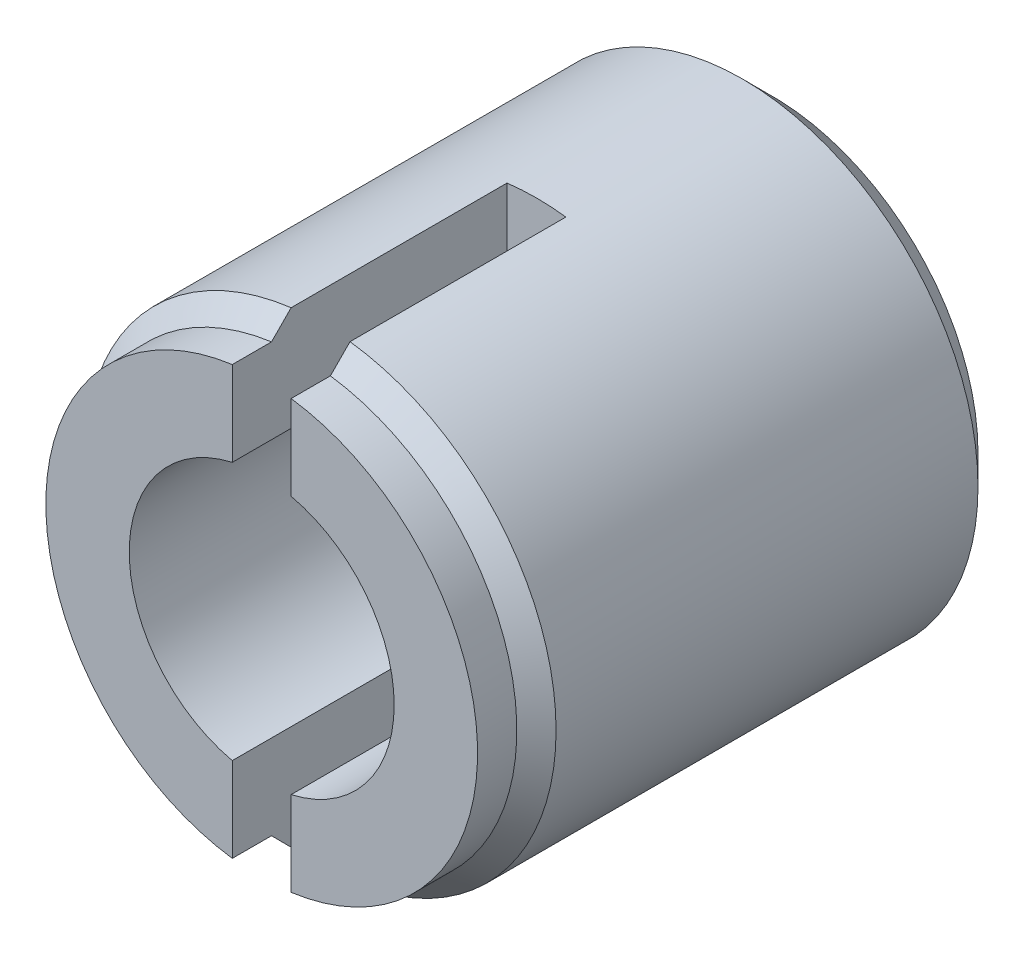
ISO-10303-21;
HEADER;
FILE_DESCRIPTION(('STEP AP214'),'2;1');
FILE_NAME('part.step','',(''),(''),'','','');
FILE_SCHEMA(('AUTOMOTIVE_DESIGN { 1 0 10303 214 1 1 1 1 }'));
ENDSEC;
DATA;
#1=APPLICATION_CONTEXT('core data for automotive mechanical design processes');
#2=APPLICATION_PROTOCOL_DEFINITION('international standard','automotive_design',2000,#1);
#3=PRODUCT_CONTEXT('',#1,'mechanical');
#4=PRODUCT('Part','Part','',(#3));
#5=PRODUCT_RELATED_PRODUCT_CATEGORY('part','',(#4));
#6=PRODUCT_DEFINITION_FORMATION('','',#4);
#7=PRODUCT_DEFINITION_CONTEXT('part definition',#1,'design');
#8=PRODUCT_DEFINITION('design','',#6,#7);
#9=PRODUCT_DEFINITION_SHAPE('','',#8);
#10=(LENGTH_UNIT() NAMED_UNIT(*) SI_UNIT(.MILLI.,.METRE.));
#11=(NAMED_UNIT(*) PLANE_ANGLE_UNIT() SI_UNIT($,.RADIAN.));
#12=(NAMED_UNIT(*) SI_UNIT($,.STERADIAN.) SOLID_ANGLE_UNIT());
#13=UNCERTAINTY_MEASURE_WITH_UNIT(LENGTH_MEASURE(1.E-05),#10,'distance_accuracy_value','');
#14=(GEOMETRIC_REPRESENTATION_CONTEXT(3) GLOBAL_UNCERTAINTY_ASSIGNED_CONTEXT((#13)) GLOBAL_UNIT_ASSIGNED_CONTEXT((#10,
#11,#12)) REPRESENTATION_CONTEXT('',''));
#15=CARTESIAN_POINT('',(0.,0.,0.));
#16=DIRECTION('',(0.,0.,1.));
#17=DIRECTION('',(1.,0.,0.));
#18=AXIS2_PLACEMENT_3D('',#15,#16,#17);
#19=CARTESIAN_POINT('',(0.,0.,0.));
#20=DIRECTION('',(0.,0.,1.));
#21=DIRECTION('',(1.,0.,0.));
#22=AXIS2_PLACEMENT_3D('',#19,#20,#21);
#23=PLANE('',#22);
#24=DIRECTION('',(0.,-1.,0.));
#25=VECTOR('',#24,1.);
#26=CARTESIAN_POINT('',(-0.749999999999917,6.5,0.));
#27=LINE('',#26,#25);
#28=CARTESIAN_POINT('',(-0.749999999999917,5.44862367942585,0.));
#29=VERTEX_POINT('',#28);
#30=CARTESIAN_POINT('',(-0.749999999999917,3.29061164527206,0.));
#31=VERTEX_POINT('',#30);
#32=EDGE_CURVE('E250',#29,#31,#27,.T.);
#33=ORIENTED_EDGE('',*,*,#32,.F.);
#34=CARTESIAN_POINT('',(0.,0.,0.));
#35=DIRECTION('',(0.,0.,1.));
#36=DIRECTION('',(1.,0.,0.));
#37=AXIS2_PLACEMENT_3D('',#34,#35,#36);
#38=CIRCLE('',#37,5.5);
#39=CARTESIAN_POINT('',(-0.749999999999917,-5.44862367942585,0.));
#40=VERTEX_POINT('',#39);
#41=EDGE_CURVE('E161',#29,#40,#38,.T.);
#42=ORIENTED_EDGE('',*,*,#41,.T.);
#43=CARTESIAN_POINT('',(-0.749999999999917,-3.29061164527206,0.));
#44=VERTEX_POINT('',#43);
#45=EDGE_CURVE('E257',#44,#40,#27,.T.);
#46=ORIENTED_EDGE('',*,*,#45,.F.);
#47=CARTESIAN_POINT('',(0.,0.,0.));
#48=DIRECTION('',(0.,0.,1.));
#49=DIRECTION('',(1.,0.,0.));
#50=AXIS2_PLACEMENT_3D('',#47,#48,#49);
#51=CIRCLE('',#50,3.375);
#52=EDGE_CURVE('E180',#31,#44,#51,.T.);
#53=ORIENTED_EDGE('',*,*,#52,.F.);
#54=EDGE_LOOP('',(#33,#42,#46,#53));
#55=FACE_BOUND('',#54,.T.);
#56=ADVANCED_FACE('F45',(#55),#23,.T.);
#57=CARTESIAN_POINT('',(0.,0.,-1.));
#58=DIRECTION('',(0.,0.,1.));
#59=DIRECTION('',(1.,0.,0.));
#60=AXIS2_PLACEMENT_3D('',#57,#58,#59);
#61=CYLINDRICAL_SURFACE('',#60,5.5);
#62=DIRECTION('',(0.,0.,1.));
#63=VECTOR('',#62,1.);
#64=CARTESIAN_POINT('',(-0.749999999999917,-5.44862367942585,-1.));
#65=LINE('',#64,#63);
#66=CARTESIAN_POINT('',(-0.749999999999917,-5.44862367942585,-1.));
#67=VERTEX_POINT('',#66);
#68=EDGE_CURVE('E264',#40,#67,#65,.F.);
#69=ORIENTED_EDGE('',*,*,#68,.F.);
#70=ORIENTED_EDGE('',*,*,#41,.F.);
#71=DIRECTION('',(0.,0.,1.));
#72=VECTOR('',#71,1.);
#73=CARTESIAN_POINT('',(-0.749999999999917,5.44862367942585,-1.));
#74=LINE('',#73,#72);
#75=CARTESIAN_POINT('',(-0.749999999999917,5.44862367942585,-1.));
#76=VERTEX_POINT('',#75);
#77=EDGE_CURVE('E262',#76,#29,#74,.T.);
#78=ORIENTED_EDGE('',*,*,#77,.F.);
#79=CARTESIAN_POINT('',(0.,0.,-1.));
#80=DIRECTION('',(0.,0.,1.));
#81=DIRECTION('',(1.,0.,0.));
#82=AXIS2_PLACEMENT_3D('',#79,#80,#81);
#83=CIRCLE('',#82,5.5);
#84=EDGE_CURVE('E177',#76,#67,#83,.T.);
#85=ORIENTED_EDGE('',*,*,#84,.T.);
#86=EDGE_LOOP('',(#69,#70,#78,#85));
#87=FACE_BOUND('',#86,.T.);
#88=ADVANCED_FACE('F221',(#87),#61,.T.);
#89=CARTESIAN_POINT('',(0.,0.,-1.5));
#90=DIRECTION('',(0.,0.,-1.));
#91=DIRECTION('',(-1.,0.,0.));
#92=AXIS2_PLACEMENT_3D('',#89,#90,#91);
#93=CONICAL_SURFACE('',#92,6.,0.785398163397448);
#94=CARTESIAN_POINT('',(-0.749999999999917,13.1851336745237,-8.70644728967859));
#95=CARTESIAN_POINT('',(-0.749999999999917,12.736592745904,-8.25863569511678));
#96=CARTESIAN_POINT('',(-0.749999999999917,12.2880201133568,-7.81085584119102));
#97=CARTESIAN_POINT('',(-0.749999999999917,11.3907667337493,-6.91539431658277));
#98=CARTESIAN_POINT('',(-0.749999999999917,10.9420859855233,-6.46771264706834));
#99=CARTESIAN_POINT('',(-0.749999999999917,10.0444681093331,-5.572378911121));
#100=CARTESIAN_POINT('',(-0.749999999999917,9.59553094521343,-5.12472688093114));
#101=CARTESIAN_POINT('',(-0.749999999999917,8.69744500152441,-4.22964505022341));
#102=CARTESIAN_POINT('',(-0.749999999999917,8.24829622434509,-3.78221524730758));
#103=CARTESIAN_POINT('',(-0.749999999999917,7.33438080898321,-2.87249069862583));
#104=CARTESIAN_POINT('',(-0.749999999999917,6.86960238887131,-2.41020778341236));
#105=CARTESIAN_POINT('',(-0.749999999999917,6.17193034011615,-1.71727512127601));
#106=CARTESIAN_POINT('',(-0.749999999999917,5.93928489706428,-1.48637553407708));
#107=CARTESIAN_POINT('',(-0.749999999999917,5.47375760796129,-1.02481637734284));
#108=CARTESIAN_POINT('',(-0.749999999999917,5.24087576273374,-0.794156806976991));
#109=CARTESIAN_POINT('',(-0.749999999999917,4.77480411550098,-0.333224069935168));
#110=CARTESIAN_POINT('',(-0.749999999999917,4.54161436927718,-0.102950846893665));
#111=CARTESIAN_POINT('',(-0.749999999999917,4.07469291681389,0.357051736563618));
#112=CARTESIAN_POINT('',(-0.749999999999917,3.84096120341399,0.586781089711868));
#113=CARTESIAN_POINT('',(-0.749999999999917,3.37262751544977,1.04532489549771));
#114=CARTESIAN_POINT('',(-0.749999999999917,3.13802559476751,1.27413940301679));
#115=CARTESIAN_POINT('',(-0.749999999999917,2.78486416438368,1.61605698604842));
#116=CARTESIAN_POINT('',(-0.749999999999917,2.66693520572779,1.72981093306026));
#117=CARTESIAN_POINT('',(-0.749999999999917,2.4304597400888,1.95667467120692));
#118=CARTESIAN_POINT('',(-0.749999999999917,2.31191323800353,2.06978446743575));
#119=CARTESIAN_POINT('',(-0.749999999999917,2.12885004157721,2.24299338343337));
#120=CARTESIAN_POINT('',(-0.749999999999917,2.06466849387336,2.3034465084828));
#121=CARTESIAN_POINT('',(-0.749999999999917,1.93594853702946,2.42397386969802));
#122=CARTESIAN_POINT('',(-0.749999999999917,1.87141012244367,2.48404810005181));
#123=CARTESIAN_POINT('',(-0.749999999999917,1.74208397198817,2.6034923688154));
#124=CARTESIAN_POINT('',(-0.749999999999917,1.67729779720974,2.66286409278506));
#125=CARTESIAN_POINT('',(-0.749999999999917,1.54709893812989,2.78091118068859));
#126=CARTESIAN_POINT('',(-0.749999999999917,1.48168627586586,2.83958656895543));
#127=CARTESIAN_POINT('',(-0.749999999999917,1.32766860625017,2.97570825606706));
#128=CARTESIAN_POINT('',(-0.749999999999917,1.2387214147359,3.05277214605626));
#129=CARTESIAN_POINT('',(-0.749999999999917,1.1030978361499,3.16631265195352));
#130=CARTESIAN_POINT('',(-0.749999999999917,1.05737851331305,3.20392965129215));
#131=CARTESIAN_POINT('',(-0.749999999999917,0.96506903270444,3.27807629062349));
#132=CARTESIAN_POINT('',(-0.749999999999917,0.918478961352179,3.31460603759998));
#133=CARTESIAN_POINT('',(-0.749999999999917,0.823540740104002,3.38656112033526));
#134=CARTESIAN_POINT('',(-0.749999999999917,0.775178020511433,3.42196736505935));
#135=CARTESIAN_POINT('',(-0.749999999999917,0.676711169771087,3.4904545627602));
#136=CARTESIAN_POINT('',(-0.749999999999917,0.626604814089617,3.52353236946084));
#137=CARTESIAN_POINT('',(-0.749999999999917,0.524525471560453,3.58567388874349));
#138=CARTESIAN_POINT('',(-0.749999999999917,0.47257253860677,3.61477004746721));
#139=CARTESIAN_POINT('',(-0.749999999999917,0.365715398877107,3.66687999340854));
#140=CARTESIAN_POINT('',(-0.749999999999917,0.310820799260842,3.6899122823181));
#141=CARTESIAN_POINT('',(-0.749999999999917,0.228557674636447,3.71632578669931));
#142=CARTESIAN_POINT('',(-0.749999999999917,0.202441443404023,3.72358425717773));
#143=CARTESIAN_POINT('',(-0.749999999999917,0.14964038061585,3.73564917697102));
#144=CARTESIAN_POINT('',(-0.749999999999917,0.122955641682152,3.74045602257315));
#145=CARTESIAN_POINT('',(-0.749999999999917,0.0693796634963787,3.74726330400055));
#146=CARTESIAN_POINT('',(-0.749999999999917,0.0424905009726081,3.74927975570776));
#147=CARTESIAN_POINT('',(-0.749999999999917,-0.0113498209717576,3.75039703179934));
#148=CARTESIAN_POINT('',(-0.749999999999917,-0.0383009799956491,3.74949787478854));
#149=CARTESIAN_POINT('',(-0.749999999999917,-0.0918466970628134,3.74486657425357));
#150=CARTESIAN_POINT('',(-0.749999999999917,-0.118442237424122,3.74114552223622));
#151=CARTESIAN_POINT('',(-0.749999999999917,-0.171152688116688,3.73115515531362));
#152=CARTESIAN_POINT('',(-0.749999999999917,-0.197267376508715,3.7248846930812));
#153=CARTESIAN_POINT('',(-0.749999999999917,-0.249055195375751,3.71012208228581));
#154=CARTESIAN_POINT('',(-0.749999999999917,-0.274723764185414,3.70161418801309));
#155=CARTESIAN_POINT('',(-0.749999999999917,-0.325378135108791,3.68279852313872));
#156=CARTESIAN_POINT('',(-0.749999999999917,-0.350364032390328,3.67249100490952));
#157=CARTESIAN_POINT('',(-0.749999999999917,-0.417367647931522,3.64252891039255));
#158=CARTESIAN_POINT('',(-0.749999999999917,-0.458754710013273,3.62147075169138));
#159=CARTESIAN_POINT('',(-0.749999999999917,-0.539945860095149,3.57647408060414));
#160=CARTESIAN_POINT('',(-0.749999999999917,-0.57974818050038,3.55253246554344));
#161=CARTESIAN_POINT('',(-0.749999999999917,-0.658212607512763,3.5025904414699));
#162=CARTESIAN_POINT('',(-0.749999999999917,-0.696870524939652,3.47658350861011));
#163=CARTESIAN_POINT('',(-0.749999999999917,-0.773199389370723,3.42315328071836));
#164=CARTESIAN_POINT('',(-0.749999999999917,-0.810870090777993,3.39572963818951));
#165=CARTESIAN_POINT('',(-0.749999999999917,-0.923414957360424,3.31143699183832));
#166=CARTESIAN_POINT('',(-0.749999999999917,-0.997121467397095,3.25301354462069));
#167=CARTESIAN_POINT('',(-0.749999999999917,-1.10615040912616,3.16371701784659));
#168=CARTESIAN_POINT('',(-0.749999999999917,-1.1421987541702,3.13370913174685));
#169=CARTESIAN_POINT('',(-0.749999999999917,-1.21390128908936,3.07322670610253));
#170=CARTESIAN_POINT('',(-0.749999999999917,-1.2495554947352,3.04275218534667));
#171=CARTESIAN_POINT('',(-0.749999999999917,-1.3545517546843,2.95207293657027));
#172=CARTESIAN_POINT('',(-0.749999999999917,-1.42344753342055,2.89135267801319));
#173=CARTESIAN_POINT('',(-0.749999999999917,-1.56040683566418,2.76897864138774));
#174=CARTESIAN_POINT('',(-0.749999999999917,-1.62847032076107,2.707324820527));
#175=CARTESIAN_POINT('',(-0.749999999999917,-1.83179592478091,2.52138236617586));
#176=CARTESIAN_POINT('',(-0.749999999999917,-1.96617451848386,2.39612917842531));
#177=CARTESIAN_POINT('',(-0.749999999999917,-2.23378193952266,2.14409118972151));
#178=CARTESIAN_POINT('',(-0.749999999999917,-2.3670092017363,2.017304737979));
#179=CARTESIAN_POINT('',(-0.749999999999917,-2.63263206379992,1.76288561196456));
#180=CARTESIAN_POINT('',(-0.749999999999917,-2.76502773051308,1.63525300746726));
#181=CARTESIAN_POINT('',(-0.749999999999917,-3.02794766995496,1.38072127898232));
#182=CARTESIAN_POINT('',(-0.749999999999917,-3.15847735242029,1.25382773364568));
#183=CARTESIAN_POINT('',(-0.749999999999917,-3.41916978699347,0.999658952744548));
#184=CARTESIAN_POINT('',(-0.749999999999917,-3.54933253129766,0.872383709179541));
#185=CARTESIAN_POINT('',(-0.749999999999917,-3.93929772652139,0.490281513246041));
#186=CARTESIAN_POINT('',(-0.749999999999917,-4.1987062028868,0.235052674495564));
#187=CARTESIAN_POINT('',(-0.749999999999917,-4.81964098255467,-0.377279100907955));
#188=CARTESIAN_POINT('',(-0.749999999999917,-5.18088905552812,-0.734663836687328));
#189=CARTESIAN_POINT('',(-0.749999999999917,-5.90278036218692,-1.45004571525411));
#190=CARTESIAN_POINT('',(-0.749999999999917,-6.26342359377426,-1.80804286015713));
#191=CARTESIAN_POINT('',(-0.749999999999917,-7.34498080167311,-2.88271543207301));
#192=CARTESIAN_POINT('',(-0.749999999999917,-8.06536878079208,-3.59992005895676));
#193=CARTESIAN_POINT('',(-0.749999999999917,-9.51925927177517,-5.04856858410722));
#194=CARTESIAN_POINT('',(-0.749999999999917,-10.2527505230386,-5.78002377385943));
#195=CARTESIAN_POINT('',(-0.749999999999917,-11.3526556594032,-6.87737546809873));
#196=CARTESIAN_POINT('',(-0.749999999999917,-11.7191945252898,-7.24314668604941));
#197=CARTESIAN_POINT('',(-0.749999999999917,-12.4522077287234,-7.97475344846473));
#198=CARTESIAN_POINT('',(-0.749999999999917,-12.8186820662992,-8.3405889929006));
#199=CARTESIAN_POINT('',(-0.749999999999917,-13.1851336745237,-8.70644728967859));
#200=B_SPLINE_CURVE_WITH_KNOTS('',3,(#94,#95,#96,#97,#98,#99,#100,#101,#102,#103,#104,#105,#106,
#107,#108,#109,#110,#111,#112,#113,#114,#115,#116,#117,#118,#119,#120,#121,#122,#123,#124,#125,
#126,#127,#128,#129,#130,#131,#132,#133,#134,#135,#136,#137,#138,#139,#140,#141,#142,#143,#144,
#145,#146,#147,#148,#149,#150,#151,#152,#153,#154,#155,#156,#157,#158,#159,#160,#161,#162,#163,
#164,#165,#166,#167,#168,#169,#170,#171,#172,#173,#174,#175,#176,#177,#178,#179,#180,#181,#182,
#183,#184,#185,#186,#187,#188,#189,#190,#191,#192,#193,#194,#195,#196,#197,#198,#199),
.UNSPECIFIED.,.F.,.F.,(4,2,2,2,2,2,2,2,2,2,2,2,2,2,2,2,2,2,2,2,2,2,2,2,2,2,2,2,2,2,2,2,2,2,2,2,
2,2,2,2,2,2,2,2,2,2,2,2,2,2,2,2,4),(0.,1.90145148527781,3.80292448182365,5.70487927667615,
7.60681308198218,9.57341382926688,10.5567481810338,11.5400791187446,12.5232513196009,
13.5064365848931,14.4895619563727,14.9811140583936,15.4726622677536,15.7371694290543,
16.0016806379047,16.2653051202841,16.5289203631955,16.8819352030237,17.0595407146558,
17.2371286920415,17.41689924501,17.5969082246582,17.7753497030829,17.9532402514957,
18.0344623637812,18.1156713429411,18.1964122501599,18.2771526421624,18.3575773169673,
18.43803822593,18.5190812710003,18.6001129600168,18.7392335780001,18.8785052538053,
19.0182358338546,19.1580008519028,19.4400527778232,19.5807640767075,19.7214697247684,
19.9969595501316,20.2724620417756,20.8235416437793,21.3752795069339,21.9269724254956,
22.4731031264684,23.0192453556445,24.1109899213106,25.6354610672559,27.1599374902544,
30.209538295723,33.3171619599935,34.8706270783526,36.4240915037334),.UNSPECIFIED.);
#201=CARTESIAN_POINT('',(-0.749999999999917,5.95294044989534,-1.5));
#202=VERTEX_POINT('',#201);
#203=EDGE_CURVE('E333',#202,#76,#200,.T.);
#204=ORIENTED_EDGE('',*,*,#203,.F.);
#205=CARTESIAN_POINT('',(0.,0.,-1.5));
#206=DIRECTION('',(0.,0.,1.));
#207=DIRECTION('',(1.,0.,0.));
#208=AXIS2_PLACEMENT_3D('',#205,#206,#207);
#209=CIRCLE('',#208,6.);
#210=CARTESIAN_POINT('',(-0.749999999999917,-5.95294044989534,-1.5));
#211=VERTEX_POINT('',#210);
#212=EDGE_CURVE('E193',#211,#202,#209,.F.);
#213=ORIENTED_EDGE('',*,*,#212,.F.);
#214=EDGE_CURVE('E201',#67,#211,#200,.T.);
#215=ORIENTED_EDGE('',*,*,#214,.F.);
#216=ORIENTED_EDGE('',*,*,#84,.F.);
#217=EDGE_LOOP('',(#204,#213,#215,#216));
#218=FACE_BOUND('',#217,.T.);
#219=ADVANCED_FACE('F234',(#218),#93,.T.);
#220=CARTESIAN_POINT('',(0.,0.,-13.));
#221=DIRECTION('',(0.,0.,1.));
#222=DIRECTION('',(1.,0.,0.));
#223=AXIS2_PLACEMENT_3D('',#220,#221,#222);
#224=CYLINDRICAL_SURFACE('',#223,6.);
#225=DIRECTION('',(0.,0.,1.));
#226=VECTOR('',#225,1.);
#227=CARTESIAN_POINT('',(-0.749999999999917,-5.95294044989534,-13.));
#228=LINE('',#227,#226);
#229=CARTESIAN_POINT('',(-0.749999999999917,-5.95294044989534,-7.));
#230=VERTEX_POINT('',#229);
#231=EDGE_CURVE('E267',#211,#230,#228,.F.);
#232=ORIENTED_EDGE('',*,*,#231,.F.);
#233=ORIENTED_EDGE('',*,*,#212,.T.);
#234=DIRECTION('',(0.,0.,1.));
#235=VECTOR('',#234,1.);
#236=CARTESIAN_POINT('',(-0.749999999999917,5.95294044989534,-13.));
#237=LINE('',#236,#235);
#238=CARTESIAN_POINT('',(-0.749999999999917,5.95294044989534,-7.));
#239=VERTEX_POINT('',#238);
#240=EDGE_CURVE('E280',#239,#202,#237,.T.);
#241=ORIENTED_EDGE('',*,*,#240,.F.);
#242=CARTESIAN_POINT('',(0.,0.,-7.));
#243=DIRECTION('',(0.,0.,1.));
#244=DIRECTION('',(1.,0.,0.));
#245=AXIS2_PLACEMENT_3D('',#242,#243,#244);
#246=CIRCLE('',#245,6.);
#247=CARTESIAN_POINT('',(0.749999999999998,5.95294044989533,-7.));
#248=VERTEX_POINT('',#247);
#249=EDGE_CURVE('E169',#239,#248,#246,.F.);
#250=ORIENTED_EDGE('',*,*,#249,.T.);
#251=DIRECTION('',(0.,0.,1.));
#252=VECTOR('',#251,1.);
#253=CARTESIAN_POINT('',(0.749999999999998,5.95294044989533,-13.));
#254=LINE('',#253,#252);
#255=CARTESIAN_POINT('',(0.749999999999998,5.95294044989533,-1.5));
#256=VERTEX_POINT('',#255);
#257=EDGE_CURVE('E145',#256,#248,#254,.F.);
#258=ORIENTED_EDGE('',*,*,#257,.F.);
#259=CARTESIAN_POINT('',(0.749999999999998,-5.95294044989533,-1.5));
#260=VERTEX_POINT('',#259);
#261=EDGE_CURVE('E189',#256,#260,#209,.F.);
#262=ORIENTED_EDGE('',*,*,#261,.T.);
#263=DIRECTION('',(0.,0.,1.));
#264=VECTOR('',#263,1.);
#265=CARTESIAN_POINT('',(0.749999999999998,-5.95294044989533,-13.));
#266=LINE('',#265,#264);
#267=CARTESIAN_POINT('',(0.749999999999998,-5.95294044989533,-7.));
#268=VERTEX_POINT('',#267);
#269=EDGE_CURVE('E62',#268,#260,#266,.T.);
#270=ORIENTED_EDGE('',*,*,#269,.F.);
#271=EDGE_CURVE('E162',#268,#230,#246,.F.);
#272=ORIENTED_EDGE('',*,*,#271,.T.);
#273=EDGE_LOOP('',(#232,#233,#241,#250,#258,#262,#270,#272));
#274=FACE_BOUND('',#273,.T.);
#275=CARTESIAN_POINT('',(0.,0.,-12.25));
#276=DIRECTION('',(0.,0.,1.));
#277=DIRECTION('',(1.,0.,0.));
#278=AXIS2_PLACEMENT_3D('',#275,#276,#277);
#279=CIRCLE('',#278,6.);
#280=CARTESIAN_POINT('',(6.,0.,-12.25));
#281=VERTEX_POINT('',#280);
#282=EDGE_CURVE('E181',#281,#281,#279,.T.);
#283=ORIENTED_EDGE('',*,*,#282,.T.);
#284=EDGE_LOOP('',(#283));
#285=FACE_BOUND('',#284,.T.);
#286=ADVANCED_FACE('F232',(#274,#285),#224,.T.);
#287=DIRECTION('',(0.,1.,0.));
#288=VECTOR('',#287,1.);
#289=CARTESIAN_POINT('',(0.749999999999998,6.5,0.));
#290=LINE('',#289,#288);
#291=CARTESIAN_POINT('',(0.749999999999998,-5.44862367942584,0.));
#292=VERTEX_POINT('',#291);
#293=CARTESIAN_POINT('',(0.749999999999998,-3.29061164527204,0.));
#294=VERTEX_POINT('',#293);
#295=EDGE_CURVE('E137',#292,#294,#290,.T.);
#296=ORIENTED_EDGE('',*,*,#295,.F.);
#297=CARTESIAN_POINT('',(0.749999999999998,5.44862367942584,0.));
#298=VERTEX_POINT('',#297);
#299=EDGE_CURVE('E152',#292,#298,#38,.T.);
#300=ORIENTED_EDGE('',*,*,#299,.T.);
#301=CARTESIAN_POINT('',(0.749999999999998,3.29061164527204,0.));
#302=VERTEX_POINT('',#301);
#303=EDGE_CURVE('E157',#302,#298,#290,.T.);
#304=ORIENTED_EDGE('',*,*,#303,.F.);
#305=EDGE_CURVE('E154',#294,#302,#51,.T.);
#306=ORIENTED_EDGE('',*,*,#305,.F.);
#307=EDGE_LOOP('',(#296,#300,#304,#306));
#308=FACE_BOUND('',#307,.T.);
#309=ADVANCED_FACE('F150',(#308),#23,.T.);
#310=CARTESIAN_POINT('',(0.,0.,-13.));
#311=DIRECTION('',(0.,0.,1.));
#312=DIRECTION('',(1.,0.,0.));
#313=AXIS2_PLACEMENT_3D('',#310,#311,#312);
#314=PLANE('',#313);
#315=CARTESIAN_POINT('',(0.,0.,-13.));
#316=DIRECTION('',(0.,0.,1.));
#317=DIRECTION('',(1.,0.,0.));
#318=AXIS2_PLACEMENT_3D('',#315,#316,#317);
#319=CIRCLE('',#318,5.24999999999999);
#320=CARTESIAN_POINT('',(5.24999999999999,0.,-13.));
#321=VERTEX_POINT('',#320);
#322=EDGE_CURVE('E185',#321,#321,#319,.F.);
#323=ORIENTED_EDGE('',*,*,#322,.T.);
#324=EDGE_LOOP('',(#323));
#325=FACE_BOUND('',#324,.T.);
#326=CARTESIAN_POINT('',(0.,0.,-13.));
#327=DIRECTION('',(0.,0.,1.));
#328=DIRECTION('',(1.,0.,0.));
#329=AXIS2_PLACEMENT_3D('',#326,#327,#328);
#330=CIRCLE('',#329,3.375);
#331=CARTESIAN_POINT('',(3.375,0.,-13.));
#332=VERTEX_POINT('',#331);
#333=EDGE_CURVE('E173',#332,#332,#330,.T.);
#334=ORIENTED_EDGE('',*,*,#333,.T.);
#335=EDGE_LOOP('',(#334));
#336=FACE_BOUND('',#335,.T.);
#337=ADVANCED_FACE('F225',(#325,#336),#314,.F.);
#338=CARTESIAN_POINT('',(0.,0.,0.));
#339=DIRECTION('',(0.,0.,1.));
#340=DIRECTION('',(1.,0.,0.));
#341=AXIS2_PLACEMENT_3D('',#338,#339,#340);
#342=CYLINDRICAL_SURFACE('',#341,3.375);
#343=ORIENTED_EDGE('',*,*,#52,.T.);
#344=DIRECTION('',(0.,0.,1.));
#345=VECTOR('',#344,1.);
#346=CARTESIAN_POINT('',(-0.749999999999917,-3.29061164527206,0.));
#347=LINE('',#346,#345);
#348=CARTESIAN_POINT('',(-0.749999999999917,-3.29061164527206,-7.));
#349=VERTEX_POINT('',#348);
#350=EDGE_CURVE('E286',#44,#349,#347,.F.);
#351=ORIENTED_EDGE('',*,*,#350,.T.);
#352=CARTESIAN_POINT('',(0.,0.,-7.));
#353=DIRECTION('',(0.,0.,1.));
#354=DIRECTION('',(1.,0.,0.));
#355=AXIS2_PLACEMENT_3D('',#352,#353,#354);
#356=CIRCLE('',#355,3.375);
#357=CARTESIAN_POINT('',(0.749999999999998,-3.29061164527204,-7.));
#358=VERTEX_POINT('',#357);
#359=EDGE_CURVE('E11',#358,#349,#356,.F.);
#360=ORIENTED_EDGE('',*,*,#359,.F.);
#361=DIRECTION('',(0.,0.,1.));
#362=VECTOR('',#361,1.);
#363=CARTESIAN_POINT('',(0.749999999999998,-3.29061164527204,0.));
#364=LINE('',#363,#362);
#365=EDGE_CURVE('E274',#358,#294,#364,.T.);
#366=ORIENTED_EDGE('',*,*,#365,.T.);
#367=ORIENTED_EDGE('',*,*,#305,.T.);
#368=DIRECTION('',(0.,0.,1.));
#369=VECTOR('',#368,1.);
#370=CARTESIAN_POINT('',(0.749999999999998,3.29061164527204,0.));
#371=LINE('',#370,#369);
#372=CARTESIAN_POINT('',(0.749999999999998,3.29061164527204,-7.));
#373=VERTEX_POINT('',#372);
#374=EDGE_CURVE('E268',#302,#373,#371,.F.);
#375=ORIENTED_EDGE('',*,*,#374,.T.);
#376=CARTESIAN_POINT('',(-0.749999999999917,3.29061164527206,-7.));
#377=VERTEX_POINT('',#376);
#378=EDGE_CURVE('E50',#377,#373,#356,.F.);
#379=ORIENTED_EDGE('',*,*,#378,.F.);
#380=DIRECTION('',(0.,0.,1.));
#381=VECTOR('',#380,1.);
#382=CARTESIAN_POINT('',(-0.749999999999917,3.29061164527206,0.));
#383=LINE('',#382,#381);
#384=EDGE_CURVE('E283',#377,#31,#383,.T.);
#385=ORIENTED_EDGE('',*,*,#384,.T.);
#386=EDGE_LOOP('',(#343,#351,#360,#366,#367,#375,#379,#385));
#387=FACE_BOUND('',#386,.T.);
#388=ORIENTED_EDGE('',*,*,#333,.F.);
#389=EDGE_LOOP('',(#388));
#390=FACE_BOUND('',#389,.T.);
#391=ADVANCED_FACE('F222',(#387,#390),#342,.F.);
#392=CARTESIAN_POINT('',(0.,0.,-12.25));
#393=DIRECTION('',(0.,0.,1.));
#394=DIRECTION('',(1.,0.,0.));
#395=AXIS2_PLACEMENT_3D('',#392,#393,#394);
#396=CONICAL_SURFACE('',#395,6.,0.785398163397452);
#397=ORIENTED_EDGE('',*,*,#322,.F.);
#398=EDGE_LOOP('',(#397));
#399=FACE_BOUND('',#398,.T.);
#400=ORIENTED_EDGE('',*,*,#282,.F.);
#401=EDGE_LOOP('',(#400));
#402=FACE_BOUND('',#401,.T.);
#403=ADVANCED_FACE('F220',(#399,#402),#396,.T.);
#404=DIRECTION('',(0.,0.,1.));
#405=VECTOR('',#404,1.);
#406=CARTESIAN_POINT('',(0.749999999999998,5.44862367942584,-1.));
#407=LINE('',#406,#405);
#408=CARTESIAN_POINT('',(0.749999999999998,5.44862367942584,-1.));
#409=VERTEX_POINT('',#408);
#410=EDGE_CURVE('E70',#298,#409,#407,.F.);
#411=ORIENTED_EDGE('',*,*,#410,.F.);
#412=ORIENTED_EDGE('',*,*,#299,.F.);
#413=DIRECTION('',(0.,0.,1.));
#414=VECTOR('',#413,1.);
#415=CARTESIAN_POINT('',(0.749999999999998,-5.44862367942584,-1.));
#416=LINE('',#415,#414);
#417=CARTESIAN_POINT('',(0.749999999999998,-5.44862367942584,-1.));
#418=VERTEX_POINT('',#417);
#419=EDGE_CURVE('E134',#418,#292,#416,.T.);
#420=ORIENTED_EDGE('',*,*,#419,.F.);
#421=EDGE_CURVE('E167',#418,#409,#83,.T.);
#422=ORIENTED_EDGE('',*,*,#421,.T.);
#423=EDGE_LOOP('',(#411,#412,#420,#422));
#424=FACE_BOUND('',#423,.T.);
#425=ADVANCED_FACE('F159',(#424),#61,.T.);
#426=CARTESIAN_POINT('',(0.749999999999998,-13.1851336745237,-8.70644728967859));
#427=CARTESIAN_POINT('',(0.749999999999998,-12.736592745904,-8.25863569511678));
#428=CARTESIAN_POINT('',(0.749999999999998,-12.2880201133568,-7.81085584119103));
#429=CARTESIAN_POINT('',(0.749999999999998,-11.3907667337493,-6.91539431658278));
#430=CARTESIAN_POINT('',(0.749999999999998,-10.9420859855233,-6.46771264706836));
#431=CARTESIAN_POINT('',(0.749999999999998,-10.0444681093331,-5.57237891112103));
#432=CARTESIAN_POINT('',(0.749999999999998,-9.59553094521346,-5.12472688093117));
#433=CARTESIAN_POINT('',(0.749999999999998,-8.69744500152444,-4.22964505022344));
#434=CARTESIAN_POINT('',(0.749999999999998,-8.24829622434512,-3.78221524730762));
#435=CARTESIAN_POINT('',(0.749999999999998,-7.33438080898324,-2.87249069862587));
#436=CARTESIAN_POINT('',(0.749999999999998,-6.86960238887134,-2.4102077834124));
#437=CARTESIAN_POINT('',(0.749999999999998,-6.17193034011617,-1.71727512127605));
#438=CARTESIAN_POINT('',(0.749999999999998,-5.9392848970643,-1.48637553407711));
#439=CARTESIAN_POINT('',(0.749999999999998,-5.47375760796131,-1.02481637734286));
#440=CARTESIAN_POINT('',(0.749999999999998,-5.24087576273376,-0.794156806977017));
#441=CARTESIAN_POINT('',(0.749999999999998,-4.774804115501,-0.33322406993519));
#442=CARTESIAN_POINT('',(0.749999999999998,-4.54161436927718,-0.102950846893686));
#443=CARTESIAN_POINT('',(0.749999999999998,-4.07469291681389,0.3570517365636));
#444=CARTESIAN_POINT('',(0.749999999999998,-3.840961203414,0.586781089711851));
#445=CARTESIAN_POINT('',(0.749999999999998,-3.37262751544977,1.04532489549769));
#446=CARTESIAN_POINT('',(0.749999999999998,-3.13802559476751,1.27413940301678));
#447=CARTESIAN_POINT('',(0.749999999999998,-2.78486416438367,1.61605698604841));
#448=CARTESIAN_POINT('',(0.749999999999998,-2.66693520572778,1.72981093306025));
#449=CARTESIAN_POINT('',(0.749999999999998,-2.43045974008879,1.9566746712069));
#450=CARTESIAN_POINT('',(0.749999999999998,-2.31191323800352,2.06978446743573));
#451=CARTESIAN_POINT('',(0.749999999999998,-2.12885004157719,2.24299338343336));
#452=CARTESIAN_POINT('',(0.749999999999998,-2.06466849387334,2.30344650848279));
#453=CARTESIAN_POINT('',(0.749999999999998,-1.93594853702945,2.42397386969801));
#454=CARTESIAN_POINT('',(0.749999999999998,-1.87141012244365,2.4840481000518));
#455=CARTESIAN_POINT('',(0.749999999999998,-1.74208397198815,2.60349236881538));
#456=CARTESIAN_POINT('',(0.749999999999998,-1.67729779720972,2.66286409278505));
#457=CARTESIAN_POINT('',(0.749999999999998,-1.54709893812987,2.78091118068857));
#458=CARTESIAN_POINT('',(0.749999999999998,-1.48168627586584,2.83958656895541));
#459=CARTESIAN_POINT('',(0.749999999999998,-1.32766860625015,2.97570825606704));
#460=CARTESIAN_POINT('',(0.749999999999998,-1.23872141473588,3.05277214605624));
#461=CARTESIAN_POINT('',(0.749999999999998,-1.10309783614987,3.1663126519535));
#462=CARTESIAN_POINT('',(0.749999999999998,-1.05737851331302,3.20392965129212));
#463=CARTESIAN_POINT('',(0.749999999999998,-0.965069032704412,3.27807629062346));
#464=CARTESIAN_POINT('',(0.749999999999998,-0.91847896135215,3.31460603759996));
#465=CARTESIAN_POINT('',(0.749999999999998,-0.823540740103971,3.38656112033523));
#466=CARTESIAN_POINT('',(0.749999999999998,-0.775178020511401,3.42196736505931));
#467=CARTESIAN_POINT('',(0.749999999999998,-0.676711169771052,3.49045456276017));
#468=CARTESIAN_POINT('',(0.749999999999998,-0.62660481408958,3.5235323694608));
#469=CARTESIAN_POINT('',(0.749999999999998,-0.524525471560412,3.58567388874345));
#470=CARTESIAN_POINT('',(0.749999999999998,-0.472572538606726,3.61477004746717));
#471=CARTESIAN_POINT('',(0.749999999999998,-0.36571539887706,3.66687999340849));
#472=CARTESIAN_POINT('',(0.749999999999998,-0.310820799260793,3.68991228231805));
#473=CARTESIAN_POINT('',(0.749999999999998,-0.228557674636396,3.71632578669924));
#474=CARTESIAN_POINT('',(0.749999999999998,-0.202441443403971,3.72358425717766));
#475=CARTESIAN_POINT('',(0.749999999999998,-0.149640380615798,3.73564917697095));
#476=CARTESIAN_POINT('',(0.749999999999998,-0.1229556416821,3.74045602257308));
#477=CARTESIAN_POINT('',(0.749999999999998,-0.0693796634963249,3.74726330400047));
#478=CARTESIAN_POINT('',(0.749999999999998,-0.0424905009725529,3.74927975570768));
#479=CARTESIAN_POINT('',(0.749999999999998,0.0113498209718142,3.75039703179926));
#480=CARTESIAN_POINT('',(0.749999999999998,0.0383009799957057,3.74949787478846));
#481=CARTESIAN_POINT('',(0.749999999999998,0.0918466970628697,3.74486657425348));
#482=CARTESIAN_POINT('',(0.749999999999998,0.118442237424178,3.74114552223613));
#483=CARTESIAN_POINT('',(0.749999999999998,0.171152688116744,3.73115515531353));
#484=CARTESIAN_POINT('',(0.749999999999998,0.197267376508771,3.72488469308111));
#485=CARTESIAN_POINT('',(0.749999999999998,0.249055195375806,3.71012208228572));
#486=CARTESIAN_POINT('',(0.749999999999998,0.274723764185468,3.70161418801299));
#487=CARTESIAN_POINT('',(0.749999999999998,0.325378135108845,3.68279852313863));
#488=CARTESIAN_POINT('',(0.749999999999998,0.350364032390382,3.67249100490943));
#489=CARTESIAN_POINT('',(0.749999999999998,0.417367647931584,3.64252891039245));
#490=CARTESIAN_POINT('',(0.749999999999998,0.458754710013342,3.62147075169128));
#491=CARTESIAN_POINT('',(0.749999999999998,0.539945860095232,3.57647408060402));
#492=CARTESIAN_POINT('',(0.749999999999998,0.579748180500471,3.55253246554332));
#493=CARTESIAN_POINT('',(0.749999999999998,0.658212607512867,3.50259044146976));
#494=CARTESIAN_POINT('',(0.749999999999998,0.696870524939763,3.47658350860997));
#495=CARTESIAN_POINT('',(0.749999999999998,0.773199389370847,3.42315328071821));
#496=CARTESIAN_POINT('',(0.749999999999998,0.810870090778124,3.39572963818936));
#497=CARTESIAN_POINT('',(0.749999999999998,0.923414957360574,3.31143699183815));
#498=CARTESIAN_POINT('',(0.749999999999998,0.997121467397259,3.25301354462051));
#499=CARTESIAN_POINT('',(0.749999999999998,1.10615040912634,3.1637170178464));
#500=CARTESIAN_POINT('',(0.749999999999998,1.14219875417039,3.13370913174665));
#501=CARTESIAN_POINT('',(0.749999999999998,1.21390128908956,3.07322670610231));
#502=CARTESIAN_POINT('',(0.749999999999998,1.24955549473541,3.04275218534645));
#503=CARTESIAN_POINT('',(0.749999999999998,1.35455175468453,2.95207293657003));
#504=CARTESIAN_POINT('',(0.749999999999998,1.42344753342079,2.89135267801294));
#505=CARTESIAN_POINT('',(0.749999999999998,1.56040683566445,2.76897864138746));
#506=CARTESIAN_POINT('',(0.749999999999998,1.62847032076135,2.70732482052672));
#507=CARTESIAN_POINT('',(0.749999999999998,1.83179592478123,2.52138236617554));
#508=CARTESIAN_POINT('',(0.749999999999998,1.9661745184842,2.39612917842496));
#509=CARTESIAN_POINT('',(0.749999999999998,2.23378193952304,2.14409118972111));
#510=CARTESIAN_POINT('',(0.749999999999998,2.36700920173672,2.01730473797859));
#511=CARTESIAN_POINT('',(0.749999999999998,2.63263206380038,1.76288561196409));
#512=CARTESIAN_POINT('',(0.749999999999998,2.76502773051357,1.63525300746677));
#513=CARTESIAN_POINT('',(0.749999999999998,3.02794766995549,1.38072127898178));
#514=CARTESIAN_POINT('',(0.749999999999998,3.15847735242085,1.25382773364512));
#515=CARTESIAN_POINT('',(0.749999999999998,3.41916978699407,0.999658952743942));
#516=CARTESIAN_POINT('',(0.749999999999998,3.54933253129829,0.872383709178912));
#517=CARTESIAN_POINT('',(0.749999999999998,3.93929772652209,0.49028151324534));
#518=CARTESIAN_POINT('',(0.749999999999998,4.19870620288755,0.235052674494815));
#519=CARTESIAN_POINT('',(0.749999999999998,4.81964098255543,-0.37727910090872));
#520=CARTESIAN_POINT('',(0.749999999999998,5.18088905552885,-0.73466383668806));
#521=CARTESIAN_POINT('',(0.749999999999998,5.90278036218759,-1.45004571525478));
#522=CARTESIAN_POINT('',(0.749999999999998,6.26342359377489,-1.80804286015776));
#523=CARTESIAN_POINT('',(0.749999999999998,7.34498080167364,-2.88271543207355));
#524=CARTESIAN_POINT('',(0.749999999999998,8.06536878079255,-3.59992005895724));
#525=CARTESIAN_POINT('',(0.749999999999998,9.51925927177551,-5.04856858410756));
#526=CARTESIAN_POINT('',(0.749999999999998,10.2527505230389,-5.7800237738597));
#527=CARTESIAN_POINT('',(0.749999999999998,11.3526556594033,-6.8773754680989));
#528=CARTESIAN_POINT('',(0.749999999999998,11.7191945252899,-7.24314668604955));
#529=CARTESIAN_POINT('',(0.749999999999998,12.4522077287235,-7.9747534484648));
#530=CARTESIAN_POINT('',(0.749999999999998,12.8186820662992,-8.34058899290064));
#531=CARTESIAN_POINT('',(0.749999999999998,13.1851336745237,-8.70644728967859));
#532=B_SPLINE_CURVE_WITH_KNOTS('',3,(#426,#427,#428,#429,#430,#431,#432,#433,#434,#435,#436,
#437,#438,#439,#440,#441,#442,#443,#444,#445,#446,#447,#448,#449,#450,#451,#452,#453,#454,#455,
#456,#457,#458,#459,#460,#461,#462,#463,#464,#465,#466,#467,#468,#469,#470,#471,#472,#473,#474,
#475,#476,#477,#478,#479,#480,#481,#482,#483,#484,#485,#486,#487,#488,#489,#490,#491,#492,#493,
#494,#495,#496,#497,#498,#499,#500,#501,#502,#503,#504,#505,#506,#507,#508,#509,#510,#511,#512,
#513,#514,#515,#516,#517,#518,#519,#520,#521,#522,#523,#524,#525,#526,#527,#528,#529,#530,#531),
.UNSPECIFIED.,.F.,.F.,(4,2,2,2,2,2,2,2,2,2,2,2,2,2,2,2,2,2,2,2,2,2,2,2,2,2,2,2,2,2,2,2,2,2,2,2,
2,2,2,2,2,2,2,2,2,2,2,2,2,2,2,2,4),(0.,1.90145148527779,3.80292448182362,5.7048792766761,
7.60681308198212,9.57341382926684,10.5567481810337,11.5400791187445,12.5232513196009,
13.506436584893,14.4895619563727,14.9811140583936,15.4726622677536,15.7371694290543,
16.0016806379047,16.2653051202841,16.5289203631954,16.8819352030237,17.0595407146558,
17.2371286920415,17.41689924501,17.5969082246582,17.7753497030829,17.9532402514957,
18.0344623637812,18.1156713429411,18.1964122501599,18.2771526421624,18.3575773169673,
18.43803822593,18.5190812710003,18.6001129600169,18.7392335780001,18.8785052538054,
19.0182358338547,19.1580008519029,19.4400527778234,19.5807640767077,19.7214697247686,
19.9969595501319,20.2724620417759,20.8235416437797,21.3752795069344,21.9269724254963,
22.4731031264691,23.0192453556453,24.1109899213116,25.6354610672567,27.1599374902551,
30.2095382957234,33.3171619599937,34.8706270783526,36.4240915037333),.UNSPECIFIED.);
#533=EDGE_CURVE('E139',#260,#418,#532,.T.);
#534=ORIENTED_EDGE('',*,*,#533,.F.);
#535=ORIENTED_EDGE('',*,*,#261,.F.);
#536=EDGE_CURVE('E194',#409,#256,#532,.T.);
#537=ORIENTED_EDGE('',*,*,#536,.F.);
#538=ORIENTED_EDGE('',*,*,#421,.F.);
#539=EDGE_LOOP('',(#534,#535,#537,#538));
#540=FACE_BOUND('',#539,.T.);
#541=ADVANCED_FACE('F47',(#540),#93,.T.);
#542=CARTESIAN_POINT('',(0.749999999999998,6.5,-7.));
#543=DIRECTION('',(1.,0.,0.));
#544=DIRECTION('',(0.,0.,-1.));
#545=AXIS2_PLACEMENT_3D('',#542,#543,#544);
#546=PLANE('',#545);
#547=ORIENTED_EDGE('',*,*,#303,.T.);
#548=ORIENTED_EDGE('',*,*,#410,.T.);
#549=ORIENTED_EDGE('',*,*,#536,.T.);
#550=ORIENTED_EDGE('',*,*,#257,.T.);
#551=DIRECTION('',(0.,1.,0.));
#552=VECTOR('',#551,1.);
#553=CARTESIAN_POINT('',(0.749999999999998,6.5,-7.));
#554=LINE('',#553,#552);
#555=EDGE_CURVE('E305',#373,#248,#554,.T.);
#556=ORIENTED_EDGE('',*,*,#555,.F.);
#557=ORIENTED_EDGE('',*,*,#374,.F.);
#558=EDGE_LOOP('',(#547,#548,#549,#550,#556,#557));
#559=FACE_BOUND('',#558,.T.);
#560=ADVANCED_FACE('F207',(#559),#546,.F.);
#561=CARTESIAN_POINT('',(-0.749999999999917,6.5,-7.));
#562=DIRECTION('',(-1.,0.,0.));
#563=DIRECTION('',(0.,0.,1.));
#564=AXIS2_PLACEMENT_3D('',#561,#562,#563);
#565=PLANE('',#564);
#566=DIRECTION('',(0.,-1.,0.));
#567=VECTOR('',#566,1.);
#568=CARTESIAN_POINT('',(-0.749999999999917,6.5,-7.));
#569=LINE('',#568,#567);
#570=EDGE_CURVE('E302',#239,#377,#569,.T.);
#571=ORIENTED_EDGE('',*,*,#570,.F.);
#572=ORIENTED_EDGE('',*,*,#240,.T.);
#573=ORIENTED_EDGE('',*,*,#203,.T.);
#574=ORIENTED_EDGE('',*,*,#77,.T.);
#575=ORIENTED_EDGE('',*,*,#32,.T.);
#576=ORIENTED_EDGE('',*,*,#384,.F.);
#577=EDGE_LOOP('',(#571,#572,#573,#574,#575,#576));
#578=FACE_BOUND('',#577,.T.);
#579=ADVANCED_FACE('F211',(#578),#565,.F.);
#580=CARTESIAN_POINT('',(-0.749999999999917,-6.5,-7.));
#581=DIRECTION('',(0.,0.,1.));
#582=DIRECTION('',(1.,0.,0.));
#583=AXIS2_PLACEMENT_3D('',#580,#581,#582);
#584=PLANE('',#583);
#585=ORIENTED_EDGE('',*,*,#570,.T.);
#586=ORIENTED_EDGE('',*,*,#378,.T.);
#587=ORIENTED_EDGE('',*,*,#555,.T.);
#588=ORIENTED_EDGE('',*,*,#249,.F.);
#589=EDGE_LOOP('',(#585,#586,#587,#588));
#590=FACE_BOUND('',#589,.T.);
#591=ADVANCED_FACE('F301',(#590),#584,.T.);
#592=EDGE_CURVE('E311',#268,#358,#554,.T.);
#593=ORIENTED_EDGE('',*,*,#592,.T.);
#594=ORIENTED_EDGE('',*,*,#359,.T.);
#595=EDGE_CURVE('E156',#349,#230,#569,.T.);
#596=ORIENTED_EDGE('',*,*,#595,.T.);
#597=ORIENTED_EDGE('',*,*,#271,.F.);
#598=EDGE_LOOP('',(#593,#594,#596,#597));
#599=FACE_BOUND('',#598,.T.);
#600=ADVANCED_FACE('F212',(#599),#584,.T.);
#601=ORIENTED_EDGE('',*,*,#45,.T.);
#602=ORIENTED_EDGE('',*,*,#68,.T.);
#603=ORIENTED_EDGE('',*,*,#214,.T.);
#604=ORIENTED_EDGE('',*,*,#231,.T.);
#605=ORIENTED_EDGE('',*,*,#595,.F.);
#606=ORIENTED_EDGE('',*,*,#350,.F.);
#607=EDGE_LOOP('',(#601,#602,#603,#604,#605,#606));
#608=FACE_BOUND('',#607,.T.);
#609=ADVANCED_FACE('F213',(#608),#565,.F.);
#610=ORIENTED_EDGE('',*,*,#592,.F.);
#611=ORIENTED_EDGE('',*,*,#269,.T.);
#612=ORIENTED_EDGE('',*,*,#533,.T.);
#613=ORIENTED_EDGE('',*,*,#419,.T.);
#614=ORIENTED_EDGE('',*,*,#295,.T.);
#615=ORIENTED_EDGE('',*,*,#365,.F.);
#616=EDGE_LOOP('',(#610,#611,#612,#613,#614,#615));
#617=FACE_BOUND('',#616,.T.);
#618=ADVANCED_FACE('F136',(#617),#546,.F.);
#619=CLOSED_SHELL('',(#56,#88,#219,#286,#309,#337,#391,#403,#425,#541,#560,#579,#591,#600,#609,#618));
#620=MANIFOLD_SOLID_BREP('B2',#619);
#621=ADVANCED_BREP_SHAPE_REPRESENTATION('',(#18,#620),#14);
#622=SHAPE_DEFINITION_REPRESENTATION(#9,#621);
ENDSEC;
END-ISO-10303-21;
